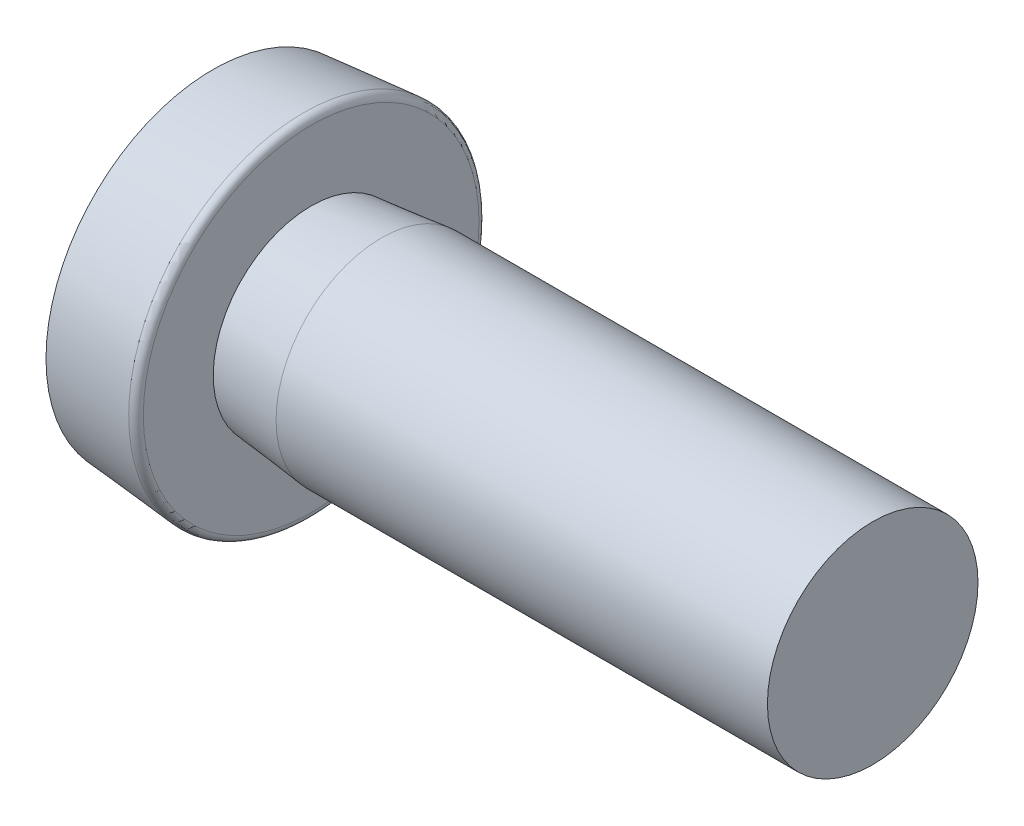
ISO-10303-21;
HEADER;
FILE_DESCRIPTION(('STEP AP214'),'2;1');
FILE_NAME('part.step','',(''),(''),'','','');
FILE_SCHEMA(('AUTOMOTIVE_DESIGN { 1 0 10303 214 1 1 1 1 }'));
ENDSEC;
DATA;
#1=APPLICATION_CONTEXT('core data for automotive mechanical design processes');
#2=APPLICATION_PROTOCOL_DEFINITION('international standard','automotive_design',2000,#1);
#3=PRODUCT_CONTEXT('',#1,'mechanical');
#4=PRODUCT('Part','Part','',(#3));
#5=PRODUCT_RELATED_PRODUCT_CATEGORY('part','',(#4));
#6=PRODUCT_DEFINITION_FORMATION('','',#4);
#7=PRODUCT_DEFINITION_CONTEXT('part definition',#1,'design');
#8=PRODUCT_DEFINITION('design','',#6,#7);
#9=PRODUCT_DEFINITION_SHAPE('','',#8);
#10=(LENGTH_UNIT() NAMED_UNIT(*) SI_UNIT(.MILLI.,.METRE.));
#11=(NAMED_UNIT(*) PLANE_ANGLE_UNIT() SI_UNIT($,.RADIAN.));
#12=(NAMED_UNIT(*) SI_UNIT($,.STERADIAN.) SOLID_ANGLE_UNIT());
#13=UNCERTAINTY_MEASURE_WITH_UNIT(LENGTH_MEASURE(1.E-05),#10,'distance_accuracy_value','');
#14=(GEOMETRIC_REPRESENTATION_CONTEXT(3) GLOBAL_UNCERTAINTY_ASSIGNED_CONTEXT((#13)) GLOBAL_UNIT_ASSIGNED_CONTEXT((#10,
#11,#12)) REPRESENTATION_CONTEXT('',''));
#15=CARTESIAN_POINT('',(0.,0.,0.));
#16=DIRECTION('',(0.,0.,1.));
#17=DIRECTION('',(1.,0.,0.));
#18=AXIS2_PLACEMENT_3D('',#15,#16,#17);
#19=CARTESIAN_POINT('',(0.,0.,0.));
#20=DIRECTION('',(1.,0.,0.));
#21=DIRECTION('',(0.,0.,-1.));
#22=AXIS2_PLACEMENT_3D('',#19,#20,#21);
#23=PLANE('',#22);
#24=CARTESIAN_POINT('',(0.,0.,0.));
#25=DIRECTION('',(1.,0.,0.));
#26=DIRECTION('',(0.,0.,-1.));
#27=AXIS2_PLACEMENT_3D('',#24,#25,#26);
#28=CIRCLE('',#27,2.37751587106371);
#29=CARTESIAN_POINT('',(0.,0.,-2.37751587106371));
#30=VERTEX_POINT('',#29);
#31=EDGE_CURVE('E325',#30,#30,#28,.T.);
#32=ORIENTED_EDGE('',*,*,#31,.F.);
#33=EDGE_LOOP('',(#32));
#34=FACE_BOUND('',#33,.T.);
#35=DIRECTION('',(0.,0.,1.));
#36=VECTOR('',#35,1.);
#37=CARTESIAN_POINT('',(0.,0.27,-0.27));
#38=LINE('',#37,#36);
#39=CARTESIAN_POINT('',(0.,0.27,-1.35));
#40=VERTEX_POINT('',#39);
#41=CARTESIAN_POINT('',(0.,0.27,-0.47));
#42=VERTEX_POINT('',#41);
#43=EDGE_CURVE('E315',#40,#42,#38,.T.);
#44=ORIENTED_EDGE('',*,*,#43,.T.);
#45=CARTESIAN_POINT('',(0.,0.47,-0.47));
#46=DIRECTION('',(1.,0.,0.));
#47=DIRECTION('',(0.,0.,-1.));
#48=AXIS2_PLACEMENT_3D('',#45,#46,#47);
#49=CIRCLE('',#48,0.2);
#50=CARTESIAN_POINT('',(0.,0.47,-0.27));
#51=VERTEX_POINT('',#50);
#52=EDGE_CURVE('E346',#42,#51,#49,.F.);
#53=ORIENTED_EDGE('',*,*,#52,.T.);
#54=DIRECTION('',(0.,1.,0.));
#55=VECTOR('',#54,1.);
#56=CARTESIAN_POINT('',(0.,1.35,-0.27));
#57=LINE('',#56,#55);
#58=CARTESIAN_POINT('',(0.,1.35,-0.27));
#59=VERTEX_POINT('',#58);
#60=EDGE_CURVE('E100',#51,#59,#57,.T.);
#61=ORIENTED_EDGE('',*,*,#60,.T.);
#62=DIRECTION('',(0.,0.,1.));
#63=VECTOR('',#62,1.);
#64=CARTESIAN_POINT('',(0.,1.35,0.27));
#65=LINE('',#64,#63);
#66=CARTESIAN_POINT('',(0.,1.35,0.27));
#67=VERTEX_POINT('',#66);
#68=EDGE_CURVE('E319',#59,#67,#65,.T.);
#69=ORIENTED_EDGE('',*,*,#68,.T.);
#70=DIRECTION('',(0.,-1.,0.));
#71=VECTOR('',#70,1.);
#72=CARTESIAN_POINT('',(0.,1.35,0.27));
#73=LINE('',#72,#71);
#74=CARTESIAN_POINT('',(0.,0.47,0.27));
#75=VERTEX_POINT('',#74);
#76=EDGE_CURVE('E373',#67,#75,#73,.T.);
#77=ORIENTED_EDGE('',*,*,#76,.T.);
#78=CARTESIAN_POINT('',(0.,0.47,0.47));
#79=DIRECTION('',(1.,0.,0.));
#80=DIRECTION('',(0.,0.,-1.));
#81=AXIS2_PLACEMENT_3D('',#78,#79,#80);
#82=CIRCLE('',#81,0.2);
#83=CARTESIAN_POINT('',(0.,0.27,0.47));
#84=VERTEX_POINT('',#83);
#85=EDGE_CURVE('E344',#75,#84,#82,.F.);
#86=ORIENTED_EDGE('',*,*,#85,.T.);
#87=DIRECTION('',(0.,0.,1.));
#88=VECTOR('',#87,1.);
#89=CARTESIAN_POINT('',(0.,0.27,1.35));
#90=LINE('',#89,#88);
#91=CARTESIAN_POINT('',(0.,0.27,1.35));
#92=VERTEX_POINT('',#91);
#93=EDGE_CURVE('E377',#84,#92,#90,.T.);
#94=ORIENTED_EDGE('',*,*,#93,.T.);
#95=DIRECTION('',(0.,-1.,0.));
#96=VECTOR('',#95,1.);
#97=CARTESIAN_POINT('',(0.,0.27,1.35));
#98=LINE('',#97,#96);
#99=CARTESIAN_POINT('',(0.,-0.27,1.35));
#100=VERTEX_POINT('',#99);
#101=EDGE_CURVE('E379',#92,#100,#98,.T.);
#102=ORIENTED_EDGE('',*,*,#101,.T.);
#103=DIRECTION('',(0.,0.,-1.));
#104=VECTOR('',#103,1.);
#105=CARTESIAN_POINT('',(0.,-0.27,1.35));
#106=LINE('',#105,#104);
#107=CARTESIAN_POINT('',(0.,-0.27,0.47));
#108=VERTEX_POINT('',#107);
#109=EDGE_CURVE('E307',#100,#108,#106,.T.);
#110=ORIENTED_EDGE('',*,*,#109,.T.);
#111=CARTESIAN_POINT('',(0.,-0.47,0.47));
#112=DIRECTION('',(1.,0.,0.));
#113=DIRECTION('',(0.,0.,-1.));
#114=AXIS2_PLACEMENT_3D('',#111,#112,#113);
#115=CIRCLE('',#114,0.2);
#116=CARTESIAN_POINT('',(0.,-0.47,0.27));
#117=VERTEX_POINT('',#116);
#118=EDGE_CURVE('E340',#108,#117,#115,.F.);
#119=ORIENTED_EDGE('',*,*,#118,.T.);
#120=DIRECTION('',(0.,-1.,0.));
#121=VECTOR('',#120,1.);
#122=CARTESIAN_POINT('',(0.,-0.27,0.27));
#123=LINE('',#122,#121);
#124=CARTESIAN_POINT('',(0.,-1.35,0.27));
#125=VERTEX_POINT('',#124);
#126=EDGE_CURVE('E304',#117,#125,#123,.T.);
#127=ORIENTED_EDGE('',*,*,#126,.T.);
#128=DIRECTION('',(0.,0.,-1.));
#129=VECTOR('',#128,1.);
#130=CARTESIAN_POINT('',(0.,-1.35,0.27));
#131=LINE('',#130,#129);
#132=CARTESIAN_POINT('',(0.,-1.35,-0.270000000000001));
#133=VERTEX_POINT('',#132);
#134=EDGE_CURVE('E294',#125,#133,#131,.T.);
#135=ORIENTED_EDGE('',*,*,#134,.T.);
#136=DIRECTION('',(0.,1.,0.));
#137=VECTOR('',#136,1.);
#138=CARTESIAN_POINT('',(0.,-0.27,-0.27));
#139=LINE('',#138,#137);
#140=CARTESIAN_POINT('',(0.,-0.47,-0.27));
#141=VERTEX_POINT('',#140);
#142=EDGE_CURVE('E303',#133,#141,#139,.T.);
#143=ORIENTED_EDGE('',*,*,#142,.T.);
#144=CARTESIAN_POINT('',(0.,-0.47,-0.47));
#145=DIRECTION('',(1.,0.,0.));
#146=DIRECTION('',(0.,0.,-1.));
#147=AXIS2_PLACEMENT_3D('',#144,#145,#146);
#148=CIRCLE('',#147,0.2);
#149=CARTESIAN_POINT('',(0.,-0.27,-0.47));
#150=VERTEX_POINT('',#149);
#151=EDGE_CURVE('E342',#141,#150,#148,.F.);
#152=ORIENTED_EDGE('',*,*,#151,.T.);
#153=DIRECTION('',(0.,0.,-1.));
#154=VECTOR('',#153,1.);
#155=CARTESIAN_POINT('',(0.,-0.27,-0.27));
#156=LINE('',#155,#154);
#157=CARTESIAN_POINT('',(0.,-0.27,-1.35));
#158=VERTEX_POINT('',#157);
#159=EDGE_CURVE('E162',#150,#158,#156,.T.);
#160=ORIENTED_EDGE('',*,*,#159,.T.);
#161=DIRECTION('',(0.,1.,0.));
#162=VECTOR('',#161,1.);
#163=CARTESIAN_POINT('',(0.,0.27,-1.35));
#164=LINE('',#163,#162);
#165=EDGE_CURVE('E312',#158,#40,#164,.T.);
#166=ORIENTED_EDGE('',*,*,#165,.T.);
#167=EDGE_LOOP('',(#44,#53,#61,#69,#77,#86,#94,#102,#110,#119,#127,#135,#143,#152,#160,#166));
#168=FACE_BOUND('',#167,.T.);
#169=ADVANCED_FACE('F37',(#34,#168),#23,.F.);
#170=CARTESIAN_POINT('',(2.4,0.,0.));
#171=DIRECTION('',(1.,0.,0.));
#172=DIRECTION('',(0.,1.,0.));
#173=AXIS2_PLACEMENT_3D('',#170,#171,#172);
#174=CONICAL_SURFACE('',#173,1.5,0.10471975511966);
#175=CARTESIAN_POINT('',(1.4,0.,0.));
#176=DIRECTION('',(1.,0.,0.));
#177=DIRECTION('',(0.,0.,-1.));
#178=AXIS2_PLACEMENT_3D('',#175,#176,#177);
#179=CIRCLE('',#178,1.39489576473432);
#180=CARTESIAN_POINT('',(1.4,0.,-1.39489576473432));
#181=VERTEX_POINT('',#180);
#182=EDGE_CURVE('E218',#181,#181,#179,.T.);
#183=ORIENTED_EDGE('',*,*,#182,.T.);
#184=EDGE_LOOP('',(#183));
#185=FACE_BOUND('',#184,.T.);
#186=CARTESIAN_POINT('',(2.4,0.,0.));
#187=DIRECTION('',(1.,0.,0.));
#188=DIRECTION('',(0.,1.,0.));
#189=AXIS2_PLACEMENT_3D('',#186,#187,#188);
#190=CIRCLE('',#189,1.5);
#191=CARTESIAN_POINT('',(2.4,1.5,0.));
#192=VERTEX_POINT('',#191);
#193=CARTESIAN_POINT('',(2.4,-1.5,0.));
#194=VERTEX_POINT('',#193);
#195=EDGE_CURVE('E329',#192,#194,#190,.T.);
#196=ORIENTED_EDGE('',*,*,#195,.F.);
#197=CARTESIAN_POINT('',(2.4,0.,0.));
#198=DIRECTION('',(1.,0.,0.));
#199=DIRECTION('',(0.,0.,-1.));
#200=AXIS2_PLACEMENT_3D('',#197,#198,#199);
#201=CIRCLE('',#200,1.5);
#202=EDGE_CURVE('E328',#194,#192,#201,.T.);
#203=ORIENTED_EDGE('',*,*,#202,.F.);
#204=EDGE_LOOP('',(#196,#203));
#205=FACE_BOUND('',#204,.T.);
#206=ADVANCED_FACE('F235',(#185,#205),#174,.T.);
#207=CARTESIAN_POINT('',(1.4,0.,0.));
#208=DIRECTION('',(1.,0.,0.));
#209=DIRECTION('',(0.,0.,-1.));
#210=AXIS2_PLACEMENT_3D('',#207,#208,#209);
#211=PLANE('',#210);
#212=CARTESIAN_POINT('',(1.4,0.,0.));
#213=DIRECTION('',(1.,0.,0.));
#214=DIRECTION('',(0.,0.,-1.));
#215=AXIS2_PLACEMENT_3D('',#212,#213,#214);
#216=CIRCLE('',#215,2.39086914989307);
#217=CARTESIAN_POINT('',(1.4,0.,-2.39086914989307));
#218=VERTEX_POINT('',#217);
#219=EDGE_CURVE('E46',#218,#218,#216,.T.);
#220=ORIENTED_EDGE('',*,*,#219,.T.);
#221=EDGE_LOOP('',(#220));
#222=FACE_BOUND('',#221,.T.);
#223=ORIENTED_EDGE('',*,*,#182,.F.);
#224=EDGE_LOOP('',(#223));
#225=FACE_BOUND('',#224,.T.);
#226=ADVANCED_FACE('F222',(#222,#225),#211,.T.);
#227=CARTESIAN_POINT('',(1.4,0.,0.));
#228=DIRECTION('',(1.,0.,0.));
#229=DIRECTION('',(0.,0.,-1.));
#230=AXIS2_PLACEMENT_3D('',#227,#228,#229);
#231=CONICAL_SURFACE('',#230,2.5,0.0872664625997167);
#232=CARTESIAN_POINT('',(1.29128442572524,0.,0.));
#233=DIRECTION('',(-1.,0.,0.));
#234=DIRECTION('',(0.,0.,1.));
#235=AXIS2_PLACEMENT_3D('',#232,#233,#234);
#236=CIRCLE('',#235,2.49048861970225);
#237=CARTESIAN_POINT('',(1.29128442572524,0.,2.49048861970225));
#238=VERTEX_POINT('',#237);
#239=EDGE_CURVE('E11',#238,#238,#236,.T.);
#240=ORIENTED_EDGE('',*,*,#239,.T.);
#241=EDGE_LOOP('',(#240));
#242=FACE_BOUND('',#241,.T.);
#243=ORIENTED_EDGE('',*,*,#31,.T.);
#244=EDGE_LOOP('',(#243));
#245=FACE_BOUND('',#244,.T.);
#246=ADVANCED_FACE('F250',(#242,#245),#231,.T.);
#247=CARTESIAN_POINT('',(9.4,0.,0.));
#248=DIRECTION('',(-1.,0.,0.));
#249=DIRECTION('',(0.,0.,1.));
#250=AXIS2_PLACEMENT_3D('',#247,#248,#249);
#251=CYLINDRICAL_SURFACE('',#250,1.5);
#252=ORIENTED_EDGE('',*,*,#202,.T.);
#253=ORIENTED_EDGE('',*,*,#195,.T.);
#254=EDGE_LOOP('',(#252,#253));
#255=FACE_BOUND('',#254,.T.);
#256=CARTESIAN_POINT('',(9.4,0.,0.));
#257=DIRECTION('',(1.,0.,0.));
#258=DIRECTION('',(0.,0.,-1.));
#259=AXIS2_PLACEMENT_3D('',#256,#257,#258);
#260=CIRCLE('',#259,1.5);
#261=CARTESIAN_POINT('',(9.4,0.,-1.5));
#262=VERTEX_POINT('',#261);
#263=EDGE_CURVE('E322',#262,#262,#260,.T.);
#264=ORIENTED_EDGE('',*,*,#263,.F.);
#265=EDGE_LOOP('',(#264));
#266=FACE_BOUND('',#265,.T.);
#267=ADVANCED_FACE('F246',(#255,#266),#251,.T.);
#268=CARTESIAN_POINT('',(9.4,0.,0.));
#269=DIRECTION('',(1.,0.,0.));
#270=DIRECTION('',(0.,0.,-1.));
#271=AXIS2_PLACEMENT_3D('',#268,#269,#270);
#272=PLANE('',#271);
#273=ORIENTED_EDGE('',*,*,#263,.T.);
#274=EDGE_LOOP('',(#273));
#275=FACE_BOUND('',#274,.T.);
#276=ADVANCED_FACE('F412',(#275),#272,.T.);
#277=CARTESIAN_POINT('',(0.84,1.35,0.27));
#278=DIRECTION('',(0.,0.,-1.));
#279=DIRECTION('',(0.,1.,0.));
#280=AXIS2_PLACEMENT_3D('',#277,#278,#279);
#281=PLANE('',#280);
#282=DIRECTION('',(0.,-1.,0.));
#283=VECTOR('',#282,1.);
#284=CARTESIAN_POINT('',(0.84,1.35,0.27));
#285=LINE('',#284,#283);
#286=CARTESIAN_POINT('',(0.84,0.865025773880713,0.27));
#287=VERTEX_POINT('',#286);
#288=CARTESIAN_POINT('',(0.84,0.47,0.27));
#289=VERTEX_POINT('',#288);
#290=EDGE_CURVE('E321',#287,#289,#285,.T.);
#291=ORIENTED_EDGE('',*,*,#290,.T.);
#292=DIRECTION('',(-1.,0.,0.));
#293=VECTOR('',#292,1.);
#294=CARTESIAN_POINT('',(0.84,0.47,0.27));
#295=LINE('',#294,#293);
#296=EDGE_CURVE('E350',#289,#75,#295,.T.);
#297=ORIENTED_EDGE('',*,*,#296,.T.);
#298=ORIENTED_EDGE('',*,*,#76,.F.);
#299=DIRECTION('',(-0.866025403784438,0.500000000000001,0.));
#300=VECTOR('',#299,1.);
#301=CARTESIAN_POINT('',(0.629999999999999,0.986269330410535,0.27));
#302=LINE('',#301,#300);
#303=EDGE_CURVE('E190',#287,#67,#302,.T.);
#304=ORIENTED_EDGE('',*,*,#303,.F.);
#305=EDGE_LOOP('',(#291,#297,#298,#304));
#306=FACE_BOUND('',#305,.T.);
#307=ADVANCED_FACE('F403',(#306),#281,.T.);
#308=CARTESIAN_POINT('',(0.84,0.27,1.35));
#309=DIRECTION('',(0.,-1.,0.));
#310=DIRECTION('',(0.,0.,-1.));
#311=AXIS2_PLACEMENT_3D('',#308,#309,#310);
#312=PLANE('',#311);
#313=ORIENTED_EDGE('',*,*,#93,.F.);
#314=DIRECTION('',(-1.,0.,0.));
#315=VECTOR('',#314,1.);
#316=CARTESIAN_POINT('',(0.84,0.27,0.47));
#317=LINE('',#316,#315);
#318=CARTESIAN_POINT('',(0.84,0.27,0.47));
#319=VERTEX_POINT('',#318);
#320=EDGE_CURVE('E353',#84,#319,#317,.F.);
#321=ORIENTED_EDGE('',*,*,#320,.T.);
#322=DIRECTION('',(0.,0.,1.));
#323=VECTOR('',#322,1.);
#324=CARTESIAN_POINT('',(0.84,0.27,1.35));
#325=LINE('',#324,#323);
#326=CARTESIAN_POINT('',(0.84,0.27,0.865025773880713));
#327=VERTEX_POINT('',#326);
#328=EDGE_CURVE('E92',#319,#327,#325,.T.);
#329=ORIENTED_EDGE('',*,*,#328,.T.);
#330=DIRECTION('',(-0.866025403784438,0.,0.500000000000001));
#331=VECTOR('',#330,1.);
#332=CARTESIAN_POINT('',(0.,0.27,1.35));
#333=LINE('',#332,#331);
#334=EDGE_CURVE('E215',#327,#92,#333,.T.);
#335=ORIENTED_EDGE('',*,*,#334,.T.);
#336=EDGE_LOOP('',(#313,#321,#329,#335));
#337=FACE_BOUND('',#336,.T.);
#338=ADVANCED_FACE('F273',(#337),#312,.T.);
#339=CARTESIAN_POINT('',(0.,0.27,1.35));
#340=DIRECTION('',(-0.500000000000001,0.,-0.866025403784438));
#341=DIRECTION('',(-0.866025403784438,0.,0.500000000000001));
#342=AXIS2_PLACEMENT_3D('',#339,#340,#341);
#343=PLANE('',#342);
#344=ORIENTED_EDGE('',*,*,#101,.F.);
#345=ORIENTED_EDGE('',*,*,#334,.F.);
#346=DIRECTION('',(0.,-1.,0.));
#347=VECTOR('',#346,1.);
#348=CARTESIAN_POINT('',(0.84,0.27,0.865025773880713));
#349=LINE('',#348,#347);
#350=CARTESIAN_POINT('',(0.84,-0.27,0.865025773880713));
#351=VERTEX_POINT('',#350);
#352=EDGE_CURVE('E84',#327,#351,#349,.T.);
#353=ORIENTED_EDGE('',*,*,#352,.T.);
#354=DIRECTION('',(-0.866025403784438,0.,0.500000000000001));
#355=VECTOR('',#354,1.);
#356=CARTESIAN_POINT('',(0.629999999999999,-0.27,0.986269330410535));
#357=LINE('',#356,#355);
#358=EDGE_CURVE('E209',#351,#100,#357,.T.);
#359=ORIENTED_EDGE('',*,*,#358,.T.);
#360=EDGE_LOOP('',(#344,#345,#353,#359));
#361=FACE_BOUND('',#360,.T.);
#362=ADVANCED_FACE('F269',(#361),#343,.T.);
#363=CARTESIAN_POINT('',(0.84,-0.27,1.35));
#364=DIRECTION('',(0.,1.,0.));
#365=DIRECTION('',(0.,0.,1.));
#366=AXIS2_PLACEMENT_3D('',#363,#364,#365);
#367=PLANE('',#366);
#368=DIRECTION('',(0.,0.,-1.));
#369=VECTOR('',#368,1.);
#370=CARTESIAN_POINT('',(0.84,-0.27,1.35));
#371=LINE('',#370,#369);
#372=CARTESIAN_POINT('',(0.84,-0.27,0.47));
#373=VERTEX_POINT('',#372);
#374=EDGE_CURVE('E217',#351,#373,#371,.T.);
#375=ORIENTED_EDGE('',*,*,#374,.T.);
#376=DIRECTION('',(-1.,0.,0.));
#377=VECTOR('',#376,1.);
#378=CARTESIAN_POINT('',(0.84,-0.27,0.47));
#379=LINE('',#378,#377);
#380=EDGE_CURVE('E165',#373,#108,#379,.T.);
#381=ORIENTED_EDGE('',*,*,#380,.T.);
#382=ORIENTED_EDGE('',*,*,#109,.F.);
#383=ORIENTED_EDGE('',*,*,#358,.F.);
#384=EDGE_LOOP('',(#375,#381,#382,#383));
#385=FACE_BOUND('',#384,.T.);
#386=ADVANCED_FACE('F272',(#385),#367,.T.);
#387=CARTESIAN_POINT('',(0.84,-0.27,0.27));
#388=DIRECTION('',(0.,0.,-1.));
#389=DIRECTION('',(0.,1.,0.));
#390=AXIS2_PLACEMENT_3D('',#387,#388,#389);
#391=PLANE('',#390);
#392=ORIENTED_EDGE('',*,*,#126,.F.);
#393=DIRECTION('',(-1.,0.,0.));
#394=VECTOR('',#393,1.);
#395=CARTESIAN_POINT('',(0.84,-0.47,0.27));
#396=LINE('',#395,#394);
#397=CARTESIAN_POINT('',(0.84,-0.47,0.27));
#398=VERTEX_POINT('',#397);
#399=EDGE_CURVE('E54',#117,#398,#396,.F.);
#400=ORIENTED_EDGE('',*,*,#399,.T.);
#401=DIRECTION('',(0.,-1.,0.));
#402=VECTOR('',#401,1.);
#403=CARTESIAN_POINT('',(0.84,-0.27,0.27));
#404=LINE('',#403,#402);
#405=CARTESIAN_POINT('',(0.84,-0.865025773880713,0.27));
#406=VERTEX_POINT('',#405);
#407=EDGE_CURVE('E206',#398,#406,#404,.T.);
#408=ORIENTED_EDGE('',*,*,#407,.T.);
#409=DIRECTION('',(-0.866025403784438,-0.500000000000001,0.));
#410=VECTOR('',#409,1.);
#411=CARTESIAN_POINT('',(0.,-1.35,0.27));
#412=LINE('',#411,#410);
#413=EDGE_CURVE('E202',#406,#125,#412,.T.);
#414=ORIENTED_EDGE('',*,*,#413,.T.);
#415=EDGE_LOOP('',(#392,#400,#408,#414));
#416=FACE_BOUND('',#415,.T.);
#417=ADVANCED_FACE('F281',(#416),#391,.T.);
#418=CARTESIAN_POINT('',(0.,-1.35,0.27));
#419=DIRECTION('',(-0.500000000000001,0.866025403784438,0.));
#420=DIRECTION('',(-0.866025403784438,-0.500000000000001,0.));
#421=AXIS2_PLACEMENT_3D('',#418,#419,#420);
#422=PLANE('',#421);
#423=ORIENTED_EDGE('',*,*,#134,.F.);
#424=ORIENTED_EDGE('',*,*,#413,.F.);
#425=DIRECTION('',(0.,0.,-1.));
#426=VECTOR('',#425,1.);
#427=CARTESIAN_POINT('',(0.84,-0.865025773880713,0.27));
#428=LINE('',#427,#426);
#429=CARTESIAN_POINT('',(0.84,-0.865025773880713,-0.27));
#430=VERTEX_POINT('',#429);
#431=EDGE_CURVE('E204',#406,#430,#428,.T.);
#432=ORIENTED_EDGE('',*,*,#431,.T.);
#433=DIRECTION('',(-0.866025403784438,-0.500000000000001,0.));
#434=VECTOR('',#433,1.);
#435=CARTESIAN_POINT('',(1.0976537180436,-0.716269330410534,-0.27));
#436=LINE('',#435,#434);
#437=EDGE_CURVE('E199',#430,#133,#436,.T.);
#438=ORIENTED_EDGE('',*,*,#437,.T.);
#439=EDGE_LOOP('',(#423,#424,#432,#438));
#440=FACE_BOUND('',#439,.T.);
#441=ADVANCED_FACE('F278',(#440),#422,.T.);
#442=CARTESIAN_POINT('',(0.84,-0.27,-0.27));
#443=DIRECTION('',(0.,0.,1.));
#444=DIRECTION('',(0.,-1.,0.));
#445=AXIS2_PLACEMENT_3D('',#442,#443,#444);
#446=PLANE('',#445);
#447=DIRECTION('',(0.,1.,0.));
#448=VECTOR('',#447,1.);
#449=CARTESIAN_POINT('',(0.84,-0.27,-0.27));
#450=LINE('',#449,#448);
#451=CARTESIAN_POINT('',(0.84,-0.47,-0.27));
#452=VERTEX_POINT('',#451);
#453=EDGE_CURVE('E177',#430,#452,#450,.T.);
#454=ORIENTED_EDGE('',*,*,#453,.T.);
#455=DIRECTION('',(-1.,0.,0.));
#456=VECTOR('',#455,1.);
#457=CARTESIAN_POINT('',(0.84,-0.47,-0.27));
#458=LINE('',#457,#456);
#459=EDGE_CURVE('E166',#452,#141,#458,.T.);
#460=ORIENTED_EDGE('',*,*,#459,.T.);
#461=ORIENTED_EDGE('',*,*,#142,.F.);
#462=ORIENTED_EDGE('',*,*,#437,.F.);
#463=EDGE_LOOP('',(#454,#460,#461,#462));
#464=FACE_BOUND('',#463,.T.);
#465=ADVANCED_FACE('F280',(#464),#446,.T.);
#466=CARTESIAN_POINT('',(0.84,-0.27,-0.27));
#467=DIRECTION('',(0.,1.,0.));
#468=DIRECTION('',(0.,0.,1.));
#469=AXIS2_PLACEMENT_3D('',#466,#467,#468);
#470=PLANE('',#469);
#471=ORIENTED_EDGE('',*,*,#159,.F.);
#472=DIRECTION('',(-1.,0.,0.));
#473=VECTOR('',#472,1.);
#474=CARTESIAN_POINT('',(0.84,-0.27,-0.47));
#475=LINE('',#474,#473);
#476=CARTESIAN_POINT('',(0.84,-0.27,-0.47));
#477=VERTEX_POINT('',#476);
#478=EDGE_CURVE('E155',#150,#477,#475,.F.);
#479=ORIENTED_EDGE('',*,*,#478,.T.);
#480=DIRECTION('',(0.,0.,-1.));
#481=VECTOR('',#480,1.);
#482=CARTESIAN_POINT('',(0.84,-0.27,-0.27));
#483=LINE('',#482,#481);
#484=CARTESIAN_POINT('',(0.84,-0.27,-0.865025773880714));
#485=VERTEX_POINT('',#484);
#486=EDGE_CURVE('E159',#477,#485,#483,.T.);
#487=ORIENTED_EDGE('',*,*,#486,.T.);
#488=DIRECTION('',(-0.866025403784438,0.,-0.500000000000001));
#489=VECTOR('',#488,1.);
#490=CARTESIAN_POINT('',(0.,-0.27,-1.35));
#491=LINE('',#490,#489);
#492=EDGE_CURVE('E203',#485,#158,#491,.T.);
#493=ORIENTED_EDGE('',*,*,#492,.T.);
#494=EDGE_LOOP('',(#471,#479,#487,#493));
#495=FACE_BOUND('',#494,.T.);
#496=ADVANCED_FACE('F157',(#495),#470,.T.);
#497=CARTESIAN_POINT('',(0.,0.27,-1.35));
#498=DIRECTION('',(-0.500000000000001,0.,0.866025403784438));
#499=DIRECTION('',(0.866025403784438,0.,0.500000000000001));
#500=AXIS2_PLACEMENT_3D('',#497,#498,#499);
#501=PLANE('',#500);
#502=ORIENTED_EDGE('',*,*,#165,.F.);
#503=ORIENTED_EDGE('',*,*,#492,.F.);
#504=DIRECTION('',(0.,1.,0.));
#505=VECTOR('',#504,1.);
#506=CARTESIAN_POINT('',(0.84,0.27,-0.865025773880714));
#507=LINE('',#506,#505);
#508=CARTESIAN_POINT('',(0.84,0.27,-0.865025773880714));
#509=VERTEX_POINT('',#508);
#510=EDGE_CURVE('E176',#485,#509,#507,.T.);
#511=ORIENTED_EDGE('',*,*,#510,.T.);
#512=DIRECTION('',(-0.866025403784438,0.,-0.500000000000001));
#513=VECTOR('',#512,1.);
#514=CARTESIAN_POINT('',(1.0976537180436,0.27,-0.716269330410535));
#515=LINE('',#514,#513);
#516=EDGE_CURVE('E198',#509,#40,#515,.T.);
#517=ORIENTED_EDGE('',*,*,#516,.T.);
#518=EDGE_LOOP('',(#502,#503,#511,#517));
#519=FACE_BOUND('',#518,.T.);
#520=ADVANCED_FACE('F274',(#519),#501,.T.);
#521=CARTESIAN_POINT('',(0.84,0.27,-0.27));
#522=DIRECTION('',(0.,-1.,0.));
#523=DIRECTION('',(0.,0.,-1.));
#524=AXIS2_PLACEMENT_3D('',#521,#522,#523);
#525=PLANE('',#524);
#526=DIRECTION('',(0.,0.,1.));
#527=VECTOR('',#526,1.);
#528=CARTESIAN_POINT('',(0.84,0.27,-0.27));
#529=LINE('',#528,#527);
#530=CARTESIAN_POINT('',(0.84,0.27,-0.47));
#531=VERTEX_POINT('',#530);
#532=EDGE_CURVE('E212',#509,#531,#529,.T.);
#533=ORIENTED_EDGE('',*,*,#532,.T.);
#534=DIRECTION('',(-1.,0.,0.));
#535=VECTOR('',#534,1.);
#536=CARTESIAN_POINT('',(0.84,0.27,-0.47));
#537=LINE('',#536,#535);
#538=EDGE_CURVE('E332',#531,#42,#537,.T.);
#539=ORIENTED_EDGE('',*,*,#538,.T.);
#540=ORIENTED_EDGE('',*,*,#43,.F.);
#541=ORIENTED_EDGE('',*,*,#516,.F.);
#542=EDGE_LOOP('',(#533,#539,#540,#541));
#543=FACE_BOUND('',#542,.T.);
#544=ADVANCED_FACE('F276',(#543),#525,.T.);
#545=CARTESIAN_POINT('',(0.84,1.35,-0.27));
#546=DIRECTION('',(0.,0.,1.));
#547=DIRECTION('',(0.,-1.,0.));
#548=AXIS2_PLACEMENT_3D('',#545,#546,#547);
#549=PLANE('',#548);
#550=ORIENTED_EDGE('',*,*,#60,.F.);
#551=DIRECTION('',(-1.,0.,0.));
#552=VECTOR('',#551,1.);
#553=CARTESIAN_POINT('',(0.84,0.47,-0.27));
#554=LINE('',#553,#552);
#555=CARTESIAN_POINT('',(0.84,0.47,-0.27));
#556=VERTEX_POINT('',#555);
#557=EDGE_CURVE('E348',#51,#556,#554,.F.);
#558=ORIENTED_EDGE('',*,*,#557,.T.);
#559=DIRECTION('',(0.,1.,0.));
#560=VECTOR('',#559,1.);
#561=CARTESIAN_POINT('',(0.84,1.35,-0.27));
#562=LINE('',#561,#560);
#563=CARTESIAN_POINT('',(0.84,0.865025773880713,-0.27));
#564=VERTEX_POINT('',#563);
#565=EDGE_CURVE('E196',#556,#564,#562,.T.);
#566=ORIENTED_EDGE('',*,*,#565,.T.);
#567=DIRECTION('',(-0.866025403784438,0.500000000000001,0.));
#568=VECTOR('',#567,1.);
#569=CARTESIAN_POINT('',(0.,1.35,-0.27));
#570=LINE('',#569,#568);
#571=EDGE_CURVE('E193',#564,#59,#570,.T.);
#572=ORIENTED_EDGE('',*,*,#571,.T.);
#573=EDGE_LOOP('',(#550,#558,#566,#572));
#574=FACE_BOUND('',#573,.T.);
#575=ADVANCED_FACE('F267',(#574),#549,.T.);
#576=CARTESIAN_POINT('',(0.,1.35,0.27));
#577=DIRECTION('',(-0.500000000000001,-0.866025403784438,0.));
#578=DIRECTION('',(0.866025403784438,-0.500000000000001,0.));
#579=AXIS2_PLACEMENT_3D('',#576,#577,#578);
#580=PLANE('',#579);
#581=ORIENTED_EDGE('',*,*,#68,.F.);
#582=ORIENTED_EDGE('',*,*,#571,.F.);
#583=DIRECTION('',(0.,0.,1.));
#584=VECTOR('',#583,1.);
#585=CARTESIAN_POINT('',(0.84,0.865025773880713,0.27));
#586=LINE('',#585,#584);
#587=EDGE_CURVE('E194',#564,#287,#586,.T.);
#588=ORIENTED_EDGE('',*,*,#587,.T.);
#589=ORIENTED_EDGE('',*,*,#303,.T.);
#590=EDGE_LOOP('',(#581,#582,#588,#589));
#591=FACE_BOUND('',#590,.T.);
#592=ADVANCED_FACE('F264',(#591),#580,.T.);
#593=CARTESIAN_POINT('',(0.84,-0.27,0.27));
#594=DIRECTION('',(1.,0.,0.));
#595=DIRECTION('',(0.,0.,-1.));
#596=AXIS2_PLACEMENT_3D('',#593,#594,#595);
#597=PLANE('',#596);
#598=ORIENTED_EDGE('',*,*,#290,.F.);
#599=ORIENTED_EDGE('',*,*,#587,.F.);
#600=ORIENTED_EDGE('',*,*,#565,.F.);
#601=CARTESIAN_POINT('',(0.84,0.47,-0.47));
#602=DIRECTION('',(1.,0.,0.));
#603=DIRECTION('',(0.,0.,-1.));
#604=AXIS2_PLACEMENT_3D('',#601,#602,#603);
#605=CIRCLE('',#604,0.2);
#606=EDGE_CURVE('E186',#556,#531,#605,.T.);
#607=ORIENTED_EDGE('',*,*,#606,.T.);
#608=ORIENTED_EDGE('',*,*,#532,.F.);
#609=ORIENTED_EDGE('',*,*,#510,.F.);
#610=ORIENTED_EDGE('',*,*,#486,.F.);
#611=CARTESIAN_POINT('',(0.84,-0.47,-0.47));
#612=DIRECTION('',(1.,0.,0.));
#613=DIRECTION('',(0.,0.,-1.));
#614=AXIS2_PLACEMENT_3D('',#611,#612,#613);
#615=CIRCLE('',#614,0.2);
#616=EDGE_CURVE('E173',#477,#452,#615,.T.);
#617=ORIENTED_EDGE('',*,*,#616,.T.);
#618=ORIENTED_EDGE('',*,*,#453,.F.);
#619=ORIENTED_EDGE('',*,*,#431,.F.);
#620=ORIENTED_EDGE('',*,*,#407,.F.);
#621=CARTESIAN_POINT('',(0.84,-0.47,0.47));
#622=DIRECTION('',(1.,0.,0.));
#623=DIRECTION('',(0.,0.,-1.));
#624=AXIS2_PLACEMENT_3D('',#621,#622,#623);
#625=CIRCLE('',#624,0.2);
#626=EDGE_CURVE('E182',#398,#373,#625,.T.);
#627=ORIENTED_EDGE('',*,*,#626,.T.);
#628=ORIENTED_EDGE('',*,*,#374,.F.);
#629=ORIENTED_EDGE('',*,*,#352,.F.);
#630=ORIENTED_EDGE('',*,*,#328,.F.);
#631=CARTESIAN_POINT('',(0.84,0.47,0.47));
#632=DIRECTION('',(1.,0.,0.));
#633=DIRECTION('',(0.,0.,-1.));
#634=AXIS2_PLACEMENT_3D('',#631,#632,#633);
#635=CIRCLE('',#634,0.2);
#636=EDGE_CURVE('E183',#319,#289,#635,.T.);
#637=ORIENTED_EDGE('',*,*,#636,.T.);
#638=EDGE_LOOP('',(#598,#599,#600,#607,#608,#609,#610,#617,#618,#619,#620,#627,#628,#629,#630,#637));
#639=FACE_BOUND('',#638,.T.);
#640=ADVANCED_FACE('F171',(#639),#597,.F.);
#641=CARTESIAN_POINT('',(0.84,0.47,-0.47));
#642=DIRECTION('',(-1.,0.,0.));
#643=DIRECTION('',(0.,0.,1.));
#644=AXIS2_PLACEMENT_3D('',#641,#642,#643);
#645=CYLINDRICAL_SURFACE('',#644,0.2);
#646=ORIENTED_EDGE('',*,*,#606,.F.);
#647=ORIENTED_EDGE('',*,*,#557,.F.);
#648=ORIENTED_EDGE('',*,*,#52,.F.);
#649=ORIENTED_EDGE('',*,*,#538,.F.);
#650=EDGE_LOOP('',(#646,#647,#648,#649));
#651=FACE_BOUND('',#650,.T.);
#652=ADVANCED_FACE('F254',(#651),#645,.T.);
#653=CARTESIAN_POINT('',(0.84,0.47,0.47));
#654=DIRECTION('',(-1.,0.,0.));
#655=DIRECTION('',(0.,0.,1.));
#656=AXIS2_PLACEMENT_3D('',#653,#654,#655);
#657=CYLINDRICAL_SURFACE('',#656,0.2);
#658=ORIENTED_EDGE('',*,*,#636,.F.);
#659=ORIENTED_EDGE('',*,*,#320,.F.);
#660=ORIENTED_EDGE('',*,*,#85,.F.);
#661=ORIENTED_EDGE('',*,*,#296,.F.);
#662=EDGE_LOOP('',(#658,#659,#660,#661));
#663=FACE_BOUND('',#662,.T.);
#664=ADVANCED_FACE('F257',(#663),#657,.T.);
#665=CARTESIAN_POINT('',(0.84,-0.47,-0.47));
#666=DIRECTION('',(-1.,0.,0.));
#667=DIRECTION('',(0.,0.,1.));
#668=AXIS2_PLACEMENT_3D('',#665,#666,#667);
#669=CYLINDRICAL_SURFACE('',#668,0.2);
#670=ORIENTED_EDGE('',*,*,#616,.F.);
#671=ORIENTED_EDGE('',*,*,#478,.F.);
#672=ORIENTED_EDGE('',*,*,#151,.F.);
#673=ORIENTED_EDGE('',*,*,#459,.F.);
#674=EDGE_LOOP('',(#670,#671,#672,#673));
#675=FACE_BOUND('',#674,.T.);
#676=ADVANCED_FACE('F180',(#675),#669,.T.);
#677=CARTESIAN_POINT('',(0.84,-0.47,0.47));
#678=DIRECTION('',(-1.,0.,0.));
#679=DIRECTION('',(0.,0.,1.));
#680=AXIS2_PLACEMENT_3D('',#677,#678,#679);
#681=CYLINDRICAL_SURFACE('',#680,0.2);
#682=ORIENTED_EDGE('',*,*,#626,.F.);
#683=ORIENTED_EDGE('',*,*,#399,.F.);
#684=ORIENTED_EDGE('',*,*,#118,.F.);
#685=ORIENTED_EDGE('',*,*,#380,.F.);
#686=EDGE_LOOP('',(#682,#683,#684,#685));
#687=FACE_BOUND('',#686,.T.);
#688=ADVANCED_FACE('F226',(#687),#681,.T.);
#689=CARTESIAN_POINT('',(1.3,0.,0.));
#690=DIRECTION('',(1.,0.,0.));
#691=DIRECTION('',(0.,0.,-1.));
#692=AXIS2_PLACEMENT_3D('',#689,#690,#691);
#693=TOROIDAL_SURFACE('',#692,2.39086914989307,0.1);
#694=ORIENTED_EDGE('',*,*,#239,.F.);
#695=EDGE_LOOP('',(#694));
#696=FACE_BOUND('',#695,.T.);
#697=ORIENTED_EDGE('',*,*,#219,.F.);
#698=EDGE_LOOP('',(#697));
#699=FACE_BOUND('',#698,.T.);
#700=ADVANCED_FACE('F39',(#696,#699),#693,.T.);
#701=CLOSED_SHELL('',(#169,#206,#226,#246,#267,#276,#307,#338,#362,#386,#417,#441,#465,#496,
#520,#544,#575,#592,#640,#652,#664,#676,#688,#700));
#702=MANIFOLD_SOLID_BREP('B2',#701);
#703=ADVANCED_BREP_SHAPE_REPRESENTATION('',(#18,#702),#14);
#704=SHAPE_DEFINITION_REPRESENTATION(#9,#703);
ENDSEC;
END-ISO-10303-21;
